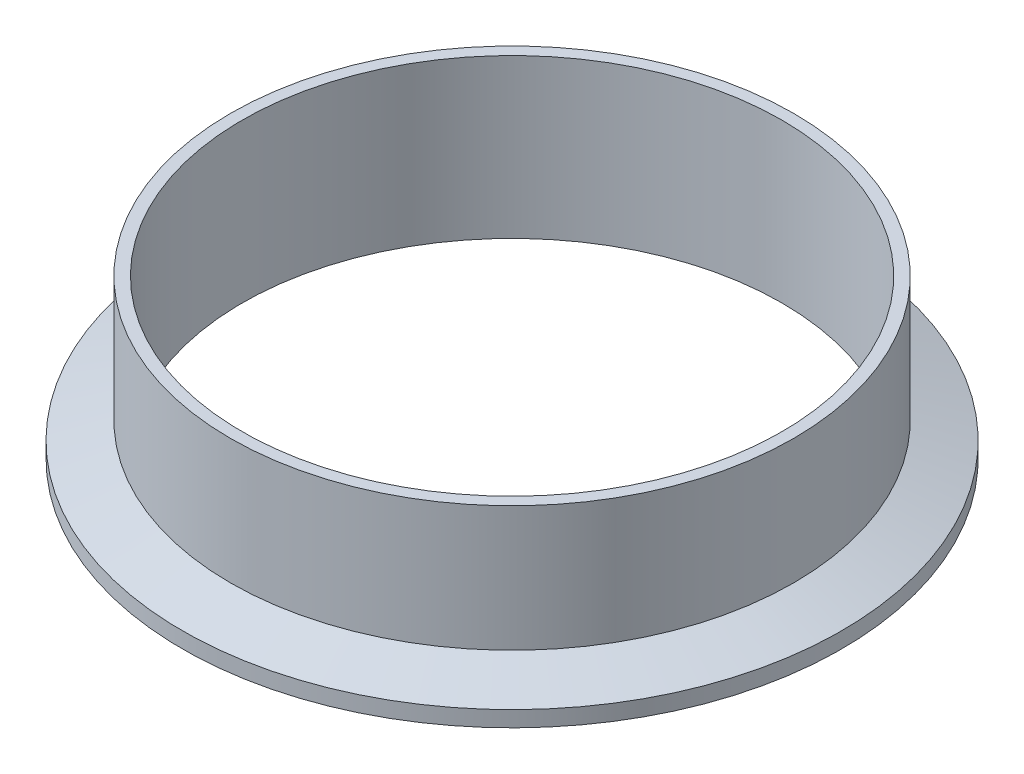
from build123d import *


with BuildPart() as part:
    # Sketch1 → Revolve2 (revolve)
    with BuildSketch(Plane.XY, mode=Mode.PRIVATE) as revolve2_sk:
        with BuildLine():
            Line((-48.6918, 0), (-48.6918, 28.575))
            Line((-48.6918, 28.575), (-50.8, 28.575))
            Line((-50.8, 28.575), (-50.8, 5.997291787))
            Line((-50.8, 5.997291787), (-59.4614, 2.8448))
            Line((-59.4614, 2.8448), (-59.4614, 0))
            Line((-59.4614, 0), (-56.618508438, 0))
            ThreePointArc((-56.618508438, 0), (-56.186311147, 0.129217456), (-55.895966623, 0.474458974))
            ThreePointArc((-55.895966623, 0.474458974), (-54.8005, 1.1938), (-53.705033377, 0.474458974))
            ThreePointArc((-53.705033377, 0.474458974), (-53.414688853, 0.129217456), (-52.982491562, 0))
            Line((-52.982491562, 0), (-48.6918, 0))
        make_face()
    revolve(revolve2_sk.sketch.rotate(Axis((0, 0, 0), (0, 1, 0)), 270), axis=Axis((0, 0, 0), (0, 1, 0)))


solid = part.part
